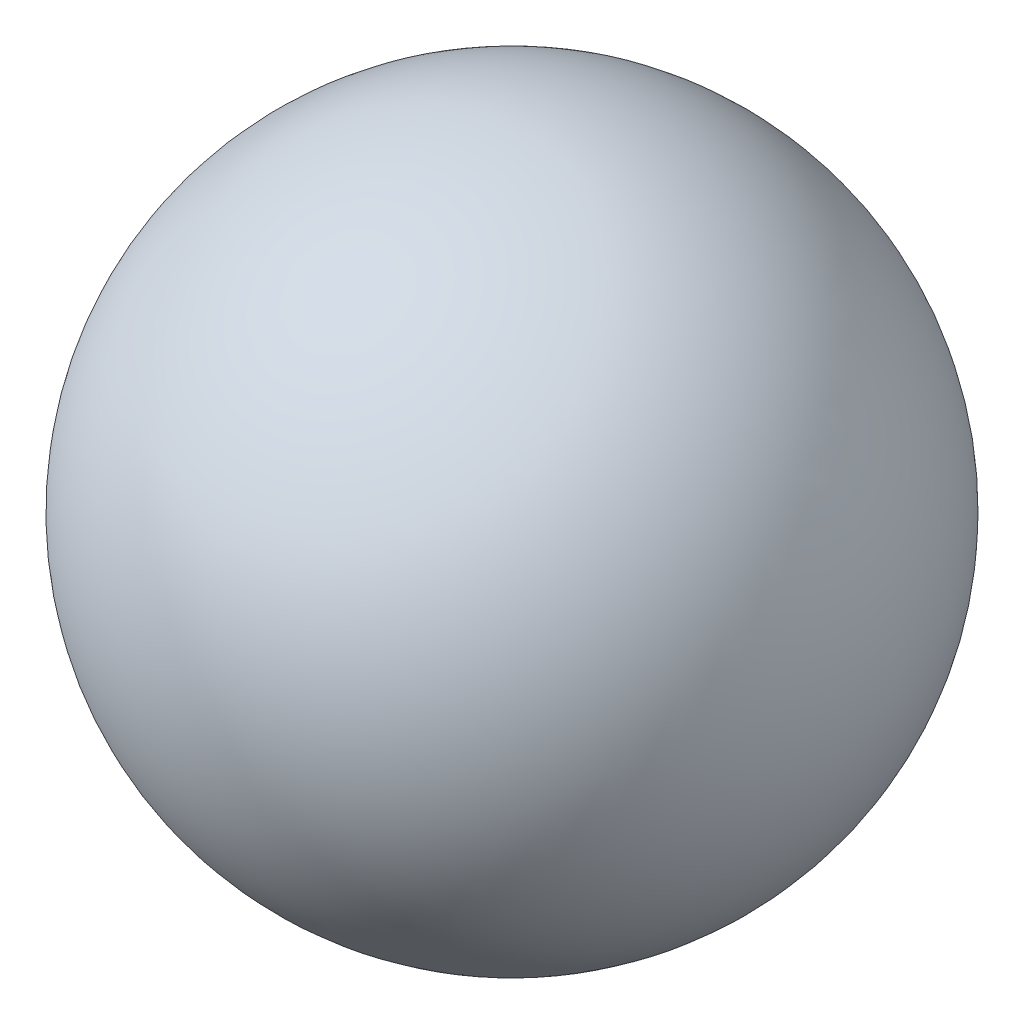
ISO-10303-21;
HEADER;
FILE_DESCRIPTION(('STEP AP214'),'2;1');
FILE_NAME('part.step','',(''),(''),'','','');
FILE_SCHEMA(('AUTOMOTIVE_DESIGN { 1 0 10303 214 1 1 1 1 }'));
ENDSEC;
DATA;
#1=APPLICATION_CONTEXT('core data for automotive mechanical design processes');
#2=APPLICATION_PROTOCOL_DEFINITION('international standard','automotive_design',2000,#1);
#3=PRODUCT_CONTEXT('',#1,'mechanical');
#4=PRODUCT('Part','Part','',(#3));
#5=PRODUCT_RELATED_PRODUCT_CATEGORY('part','',(#4));
#6=PRODUCT_DEFINITION_FORMATION('','',#4);
#7=PRODUCT_DEFINITION_CONTEXT('part definition',#1,'design');
#8=PRODUCT_DEFINITION('design','',#6,#7);
#9=PRODUCT_DEFINITION_SHAPE('','',#8);
#10=(LENGTH_UNIT() NAMED_UNIT(*) SI_UNIT(.MILLI.,.METRE.));
#11=(NAMED_UNIT(*) PLANE_ANGLE_UNIT() SI_UNIT($,.RADIAN.));
#12=(NAMED_UNIT(*) SI_UNIT($,.STERADIAN.) SOLID_ANGLE_UNIT());
#13=UNCERTAINTY_MEASURE_WITH_UNIT(LENGTH_MEASURE(1.E-05),#10,'distance_accuracy_value','');
#14=(GEOMETRIC_REPRESENTATION_CONTEXT(3) GLOBAL_UNCERTAINTY_ASSIGNED_CONTEXT((#13)) GLOBAL_UNIT_ASSIGNED_CONTEXT((#10,
#11,#12)) REPRESENTATION_CONTEXT('',''));
#15=CARTESIAN_POINT('',(0.,0.,0.));
#16=DIRECTION('',(0.,0.,1.));
#17=DIRECTION('',(1.,0.,0.));
#18=AXIS2_PLACEMENT_3D('',#15,#16,#17);
#19=CARTESIAN_POINT('',(0.,0.,0.));
#20=DIRECTION('',(0.,1.,0.));
#21=DIRECTION('',(1.,0.,0.));
#22=AXIS2_PLACEMENT_3D('',#19,#20,#21);
#23=SPHERICAL_SURFACE('',#22,315.2);
#24=CARTESIAN_POINT('',(0.,-313.067248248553,0.));
#25=DIRECTION('',(0.,1.,0.));
#26=DIRECTION('',(0.,0.,1.));
#27=AXIS2_PLACEMENT_3D('',#24,#25,#26);
#28=CIRCLE('',#27,36.6051645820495);
#29=CARTESIAN_POINT('',(0.,-313.067248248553,36.6051645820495));
#30=VERTEX_POINT('',#29);
#31=EDGE_CURVE('E48',#30,#30,#28,.T.);
#32=ORIENTED_EDGE('',*,*,#31,.F.);
#33=EDGE_LOOP('',(#32));
#34=FACE_BOUND('',#33,.T.);
#35=ADVANCED_FACE('F45',(#34),#23,.F.);
#36=CARTESIAN_POINT('',(0.,-325.2,0.));
#37=DIRECTION('',(0.,1.,0.));
#38=DIRECTION('',(0.,0.,1.));
#39=AXIS2_PLACEMENT_3D('',#36,#37,#38);
#40=CYLINDRICAL_SURFACE('',#39,36.6051645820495);
#41=ORIENTED_EDGE('',*,*,#31,.T.);
#42=EDGE_LOOP('',(#41));
#43=FACE_BOUND('',#42,.T.);
#44=CARTESIAN_POINT('',(0.,-323.133257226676,0.));
#45=DIRECTION('',(0.,1.,0.));
#46=DIRECTION('',(0.,0.,1.));
#47=AXIS2_PLACEMENT_3D('',#44,#45,#46);
#48=CIRCLE('',#47,36.6051645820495);
#49=CARTESIAN_POINT('',(0.,-323.133257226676,36.6051645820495));
#50=VERTEX_POINT('',#49);
#51=EDGE_CURVE('E10',#50,#50,#48,.T.);
#52=ORIENTED_EDGE('',*,*,#51,.F.);
#53=EDGE_LOOP('',(#52));
#54=FACE_BOUND('',#53,.T.);
#55=ADVANCED_FACE('F59',(#43,#54),#40,.F.);
#56=CARTESIAN_POINT('',(0.,0.,0.));
#57=DIRECTION('',(0.,1.,0.));
#58=DIRECTION('',(1.,0.,0.));
#59=AXIS2_PLACEMENT_3D('',#56,#57,#58);
#60=SPHERICAL_SURFACE('',#59,325.2);
#61=ORIENTED_EDGE('',*,*,#51,.T.);
#62=EDGE_LOOP('',(#61));
#63=FACE_BOUND('',#62,.T.);
#64=ADVANCED_FACE('F66',(#63),#60,.T.);
#65=CLOSED_SHELL('',(#35,#55,#64));
#66=MANIFOLD_SOLID_BREP('B2',#65);
#67=ADVANCED_BREP_SHAPE_REPRESENTATION('',(#18,#66),#14);
#68=SHAPE_DEFINITION_REPRESENTATION(#9,#67);
ENDSEC;
END-ISO-10303-21;
